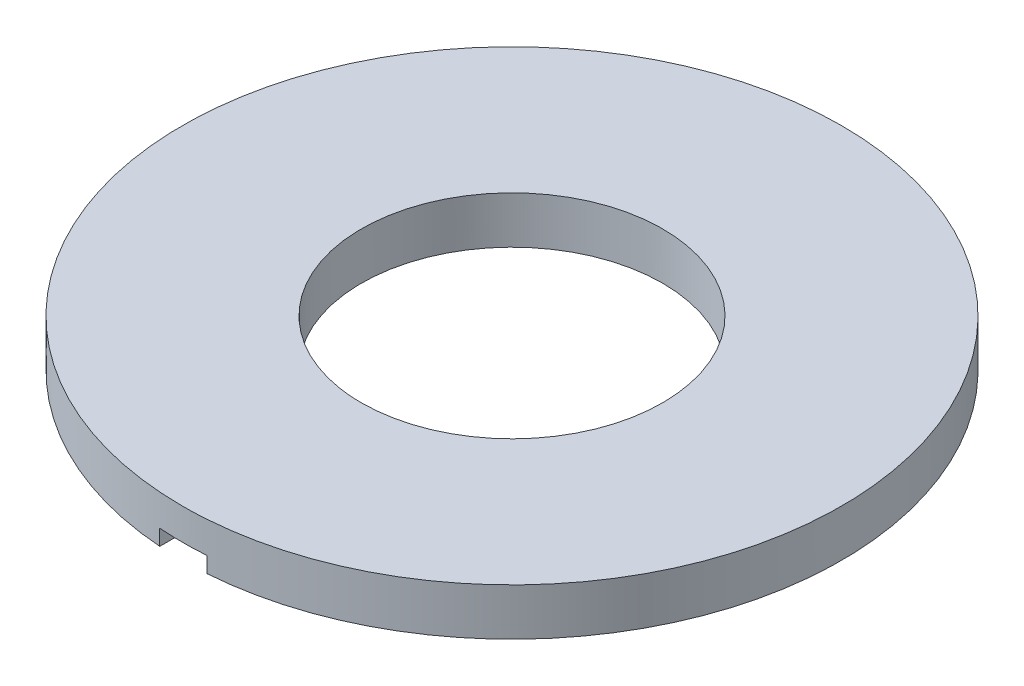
from build123d import *

# Parameters (mm, degrees)
SKETCH1_R          = 3.5
SKETCH1_R_2        = 1.6
EXTRUDE1_DEPTH     = 0.5
SKETCH2_W          = 0.5
SKETCH2_H          = 3.8
CUT_EXTRUDE1_DEPTH = 0.166666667


with BuildPart() as part:
    # Sketch1 → Extrude1 (new body)
    with BuildSketch(Plane(origin=(0, 0, 0), x_dir=(1, 0, 0), z_dir=(0, 1, 0))):
        with Locations(Location((0, 0, 0), (0, 0, 270))):
            Circle(SKETCH1_R)
        with Locations(Location((0, 0, 0), (0, 0, 270))):
            Circle(SKETCH1_R_2, mode=Mode.SUBTRACT)
    extrude(amount=EXTRUDE1_DEPTH)

    # Sketch2 → Cut-Extrude1 (cut)
    with BuildSketch(Plane.XZ):
        with Locations((0, 1.6)):
            Rectangle(SKETCH2_W, SKETCH2_H)
    extrude(amount=-CUT_EXTRUDE1_DEPTH, mode=Mode.SUBTRACT)


solid = part.part
